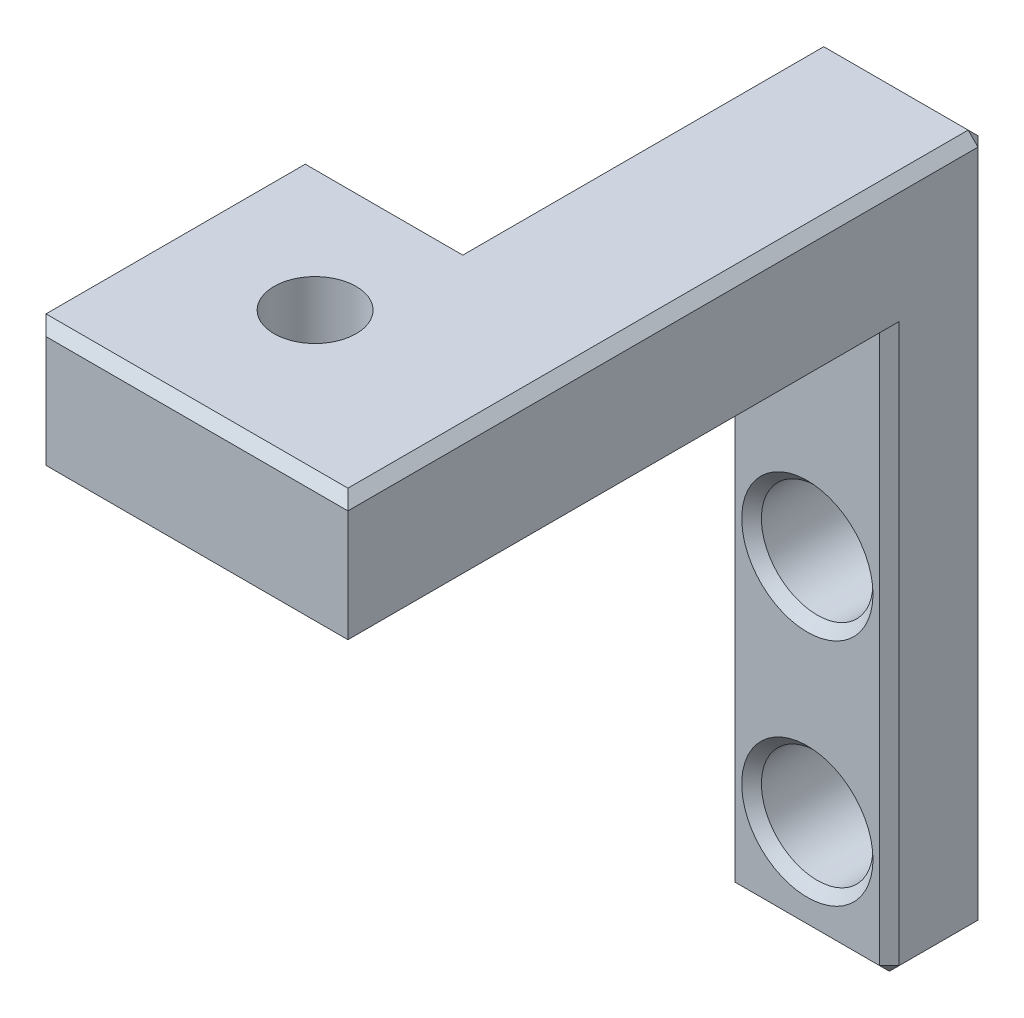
ISO-10303-21;
HEADER;
FILE_DESCRIPTION(('STEP AP214'),'2;1');
FILE_NAME('part.step','',(''),(''),'','','');
FILE_SCHEMA(('AUTOMOTIVE_DESIGN { 1 0 10303 214 1 1 1 1 }'));
ENDSEC;
DATA;
#1=APPLICATION_CONTEXT('core data for automotive mechanical design processes');
#2=APPLICATION_PROTOCOL_DEFINITION('international standard','automotive_design',2000,#1);
#3=PRODUCT_CONTEXT('',#1,'mechanical');
#4=PRODUCT('Part','Part','',(#3));
#5=PRODUCT_RELATED_PRODUCT_CATEGORY('part','',(#4));
#6=PRODUCT_DEFINITION_FORMATION('','',#4);
#7=PRODUCT_DEFINITION_CONTEXT('part definition',#1,'design');
#8=PRODUCT_DEFINITION('design','',#6,#7);
#9=PRODUCT_DEFINITION_SHAPE('','',#8);
#10=(LENGTH_UNIT() NAMED_UNIT(*) SI_UNIT(.MILLI.,.METRE.));
#11=(NAMED_UNIT(*) PLANE_ANGLE_UNIT() SI_UNIT($,.RADIAN.));
#12=(NAMED_UNIT(*) SI_UNIT($,.STERADIAN.) SOLID_ANGLE_UNIT());
#13=UNCERTAINTY_MEASURE_WITH_UNIT(LENGTH_MEASURE(1.E-05),#10,'distance_accuracy_value','');
#14=(GEOMETRIC_REPRESENTATION_CONTEXT(3) GLOBAL_UNCERTAINTY_ASSIGNED_CONTEXT((#13)) GLOBAL_UNIT_ASSIGNED_CONTEXT((#10,
#11,#12)) REPRESENTATION_CONTEXT('',''));
#15=CARTESIAN_POINT('',(0.,0.,0.));
#16=DIRECTION('',(0.,0.,1.));
#17=DIRECTION('',(1.,0.,0.));
#18=AXIS2_PLACEMENT_3D('',#15,#16,#17);
#19=CARTESIAN_POINT('',(2.5,10.5,3.));
#20=DIRECTION('',(-1.,0.,0.));
#21=DIRECTION('',(0.,-1.,0.));
#22=AXIS2_PLACEMENT_3D('',#19,#20,#21);
#23=PLANE('',#22);
#24=DIRECTION('',(0.,1.,0.));
#25=VECTOR('',#24,1.);
#26=CARTESIAN_POINT('',(2.5,10.5,19.5));
#27=LINE('',#26,#25);
#28=CARTESIAN_POINT('',(2.5,6.8,19.5));
#29=VERTEX_POINT('',#28);
#30=CARTESIAN_POINT('',(2.5,10.2,19.5));
#31=VERTEX_POINT('',#30);
#32=EDGE_CURVE('E211',#29,#31,#27,.T.);
#33=ORIENTED_EDGE('',*,*,#32,.F.);
#34=DIRECTION('',(0.,0.,-1.));
#35=VECTOR('',#34,1.);
#36=CARTESIAN_POINT('',(2.5,6.8,3.));
#37=LINE('',#36,#35);
#38=CARTESIAN_POINT('',(2.5,6.8,2.69999999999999));
#39=VERTEX_POINT('',#38);
#40=EDGE_CURVE('E262',#29,#39,#37,.T.);
#41=ORIENTED_EDGE('',*,*,#40,.T.);
#42=DIRECTION('',(0.,-1.,0.));
#43=VECTOR('',#42,1.);
#44=CARTESIAN_POINT('',(2.5,-10.5,2.69999999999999));
#45=LINE('',#44,#43);
#46=CARTESIAN_POINT('',(2.5,-10.2,2.69999999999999));
#47=VERTEX_POINT('',#46);
#48=EDGE_CURVE('E71',#39,#47,#45,.T.);
#49=ORIENTED_EDGE('',*,*,#48,.T.);
#50=DIRECTION('',(0.,0.,-1.));
#51=VECTOR('',#50,1.);
#52=CARTESIAN_POINT('',(2.5,-10.2,3.));
#53=LINE('',#52,#51);
#54=CARTESIAN_POINT('',(2.5,-10.2,0.300000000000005));
#55=VERTEX_POINT('',#54);
#56=EDGE_CURVE('E489',#47,#55,#53,.T.);
#57=ORIENTED_EDGE('',*,*,#56,.T.);
#58=DIRECTION('',(0.,1.,0.));
#59=VECTOR('',#58,1.);
#60=CARTESIAN_POINT('',(2.5,10.5,0.300000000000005));
#61=LINE('',#60,#59);
#62=CARTESIAN_POINT('',(2.5,10.2,0.300000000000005));
#63=VERTEX_POINT('',#62);
#64=EDGE_CURVE('E223',#55,#63,#61,.T.);
#65=ORIENTED_EDGE('',*,*,#64,.T.);
#66=DIRECTION('',(0.,0.,1.));
#67=VECTOR('',#66,1.);
#68=CARTESIAN_POINT('',(2.5,10.2,3.));
#69=LINE('',#68,#67);
#70=EDGE_CURVE('E199',#63,#31,#69,.T.);
#71=ORIENTED_EDGE('',*,*,#70,.T.);
#72=EDGE_LOOP('',(#33,#41,#49,#57,#65,#71));
#73=FACE_BOUND('',#72,.T.);
#74=ADVANCED_FACE('F53',(#73),#23,.F.);
#75=CARTESIAN_POINT('',(-2.5,10.5,3.));
#76=DIRECTION('',(0.,-1.,0.));
#77=DIRECTION('',(0.,0.,-1.));
#78=AXIS2_PLACEMENT_3D('',#75,#76,#77);
#79=PLANE('',#78);
#80=CARTESIAN_POINT('',(-3.,10.5,15.));
#81=DIRECTION('',(0.,-1.,0.));
#82=DIRECTION('',(0.,0.,-1.));
#83=AXIS2_PLACEMENT_3D('',#80,#81,#82);
#84=CIRCLE('',#83,1.25);
#85=CARTESIAN_POINT('',(-3.,10.5,13.75));
#86=VERTEX_POINT('',#85);
#87=EDGE_CURVE('E220',#86,#86,#84,.T.);
#88=ORIENTED_EDGE('',*,*,#87,.T.);
#89=EDGE_LOOP('',(#88));
#90=FACE_BOUND('',#89,.T.);
#91=DIRECTION('',(0.,0.,1.));
#92=VECTOR('',#91,1.);
#93=CARTESIAN_POINT('',(-2.2,10.5,3.));
#94=LINE('',#93,#92);
#95=CARTESIAN_POINT('',(-2.2,10.5,0.300000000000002));
#96=VERTEX_POINT('',#95);
#97=CARTESIAN_POINT('',(-2.2,10.5,11.3));
#98=VERTEX_POINT('',#97);
#99=EDGE_CURVE('E322',#96,#98,#94,.T.);
#100=ORIENTED_EDGE('',*,*,#99,.T.);
#101=DIRECTION('',(-1.,0.,0.));
#102=VECTOR('',#101,1.);
#103=CARTESIAN_POINT('',(-7.,10.5,11.3));
#104=LINE('',#103,#102);
#105=CARTESIAN_POINT('',(-7.,10.5,11.3));
#106=VERTEX_POINT('',#105);
#107=EDGE_CURVE('E422',#98,#106,#104,.T.);
#108=ORIENTED_EDGE('',*,*,#107,.T.);
#109=DIRECTION('',(0.,0.,-1.));
#110=VECTOR('',#109,1.);
#111=CARTESIAN_POINT('',(-7.,10.5,19.5));
#112=LINE('',#111,#110);
#113=CARTESIAN_POINT('',(-7.,10.5,19.2));
#114=VERTEX_POINT('',#113);
#115=EDGE_CURVE('E219',#114,#106,#112,.T.);
#116=ORIENTED_EDGE('',*,*,#115,.F.);
#117=DIRECTION('',(1.,0.,0.));
#118=VECTOR('',#117,1.);
#119=CARTESIAN_POINT('',(-2.5,10.5,19.2));
#120=LINE('',#119,#118);
#121=CARTESIAN_POINT('',(2.2,10.5,19.2));
#122=VERTEX_POINT('',#121);
#123=EDGE_CURVE('E419',#114,#122,#120,.T.);
#124=ORIENTED_EDGE('',*,*,#123,.T.);
#125=DIRECTION('',(0.,0.,-1.));
#126=VECTOR('',#125,1.);
#127=CARTESIAN_POINT('',(2.2,10.5,3.));
#128=LINE('',#127,#126);
#129=CARTESIAN_POINT('',(2.2,10.5,0.300000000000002));
#130=VERTEX_POINT('',#129);
#131=EDGE_CURVE('E201',#122,#130,#128,.T.);
#132=ORIENTED_EDGE('',*,*,#131,.T.);
#133=DIRECTION('',(-1.,0.,0.));
#134=VECTOR('',#133,1.);
#135=CARTESIAN_POINT('',(-2.5,10.5,0.300000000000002));
#136=LINE('',#135,#134);
#137=EDGE_CURVE('E437',#130,#96,#136,.T.);
#138=ORIENTED_EDGE('',*,*,#137,.T.);
#139=EDGE_LOOP('',(#100,#108,#116,#124,#132,#138));
#140=FACE_BOUND('',#139,.T.);
#141=ADVANCED_FACE('F555',(#90,#140),#79,.F.);
#142=CARTESIAN_POINT('',(-2.5,10.5,3.));
#143=DIRECTION('',(1.,0.,0.));
#144=DIRECTION('',(0.,1.,0.));
#145=AXIS2_PLACEMENT_3D('',#142,#143,#144);
#146=PLANE('',#145);
#147=DIRECTION('',(0.,1.,0.));
#148=VECTOR('',#147,1.);
#149=CARTESIAN_POINT('',(-2.5,6.50000000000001,2.69999999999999));
#150=LINE('',#149,#148);
#151=CARTESIAN_POINT('',(-2.5,-10.2,2.69999999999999));
#152=VERTEX_POINT('',#151);
#153=CARTESIAN_POINT('',(-2.5,6.8,2.69999999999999));
#154=VERTEX_POINT('',#153);
#155=EDGE_CURVE('E79',#152,#154,#150,.T.);
#156=ORIENTED_EDGE('',*,*,#155,.T.);
#157=DIRECTION('',(0.,0.,1.));
#158=VECTOR('',#157,1.);
#159=CARTESIAN_POINT('',(-2.5,6.8,3.));
#160=LINE('',#159,#158);
#161=CARTESIAN_POINT('',(-2.5,6.8,11.));
#162=VERTEX_POINT('',#161);
#163=EDGE_CURVE('E259',#154,#162,#160,.T.);
#164=ORIENTED_EDGE('',*,*,#163,.T.);
#165=DIRECTION('',(0.,-1.,0.));
#166=VECTOR('',#165,1.);
#167=CARTESIAN_POINT('',(-2.5,10.5,11.));
#168=LINE('',#167,#166);
#169=CARTESIAN_POINT('',(-2.5,10.2,11.));
#170=VERTEX_POINT('',#169);
#171=EDGE_CURVE('E225',#170,#162,#168,.T.);
#172=ORIENTED_EDGE('',*,*,#171,.F.);
#173=DIRECTION('',(0.,0.,-1.));
#174=VECTOR('',#173,1.);
#175=CARTESIAN_POINT('',(-2.5,10.2,3.));
#176=LINE('',#175,#174);
#177=CARTESIAN_POINT('',(-2.5,10.2,0.300000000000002));
#178=VERTEX_POINT('',#177);
#179=EDGE_CURVE('E448',#170,#178,#176,.T.);
#180=ORIENTED_EDGE('',*,*,#179,.T.);
#181=DIRECTION('',(0.,-1.,0.));
#182=VECTOR('',#181,1.);
#183=CARTESIAN_POINT('',(-2.5,10.5,0.300000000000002));
#184=LINE('',#183,#182);
#185=CARTESIAN_POINT('',(-2.5,-10.2,0.300000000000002));
#186=VERTEX_POINT('',#185);
#187=EDGE_CURVE('E445',#178,#186,#184,.T.);
#188=ORIENTED_EDGE('',*,*,#187,.T.);
#189=DIRECTION('',(0.,0.,1.));
#190=VECTOR('',#189,1.);
#191=CARTESIAN_POINT('',(-2.5,-10.2,3.));
#192=LINE('',#191,#190);
#193=EDGE_CURVE('E442',#186,#152,#192,.T.);
#194=ORIENTED_EDGE('',*,*,#193,.T.);
#195=EDGE_LOOP('',(#156,#164,#172,#180,#188,#194));
#196=FACE_BOUND('',#195,.T.);
#197=ADVANCED_FACE('F541',(#196),#146,.F.);
#198=CARTESIAN_POINT('',(-2.5,-10.5,3.));
#199=DIRECTION('',(0.,1.,0.));
#200=DIRECTION('',(0.,0.,1.));
#201=AXIS2_PLACEMENT_3D('',#198,#199,#200);
#202=PLANE('',#201);
#203=DIRECTION('',(0.,0.,-1.));
#204=VECTOR('',#203,1.);
#205=CARTESIAN_POINT('',(-2.2,-10.5,3.));
#206=LINE('',#205,#204);
#207=CARTESIAN_POINT('',(-2.2,-10.5,2.69999999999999));
#208=VERTEX_POINT('',#207);
#209=CARTESIAN_POINT('',(-2.2,-10.5,0.300000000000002));
#210=VERTEX_POINT('',#209);
#211=EDGE_CURVE('E471',#208,#210,#206,.T.);
#212=ORIENTED_EDGE('',*,*,#211,.T.);
#213=DIRECTION('',(1.,0.,0.));
#214=VECTOR('',#213,1.);
#215=CARTESIAN_POINT('',(-2.5,-10.5,0.300000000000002));
#216=LINE('',#215,#214);
#217=CARTESIAN_POINT('',(2.2,-10.5,0.300000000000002));
#218=VERTEX_POINT('',#217);
#219=EDGE_CURVE('E461',#210,#218,#216,.T.);
#220=ORIENTED_EDGE('',*,*,#219,.T.);
#221=DIRECTION('',(0.,0.,1.));
#222=VECTOR('',#221,1.);
#223=CARTESIAN_POINT('',(2.2,-10.5,3.));
#224=LINE('',#223,#222);
#225=CARTESIAN_POINT('',(2.2,-10.5,2.69999999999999));
#226=VERTEX_POINT('',#225);
#227=EDGE_CURVE('E465',#218,#226,#224,.T.);
#228=ORIENTED_EDGE('',*,*,#227,.T.);
#229=DIRECTION('',(-1.,0.,0.));
#230=VECTOR('',#229,1.);
#231=CARTESIAN_POINT('',(-2.5,-10.5,2.69999999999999));
#232=LINE('',#231,#230);
#233=EDGE_CURVE('E468',#226,#208,#232,.T.);
#234=ORIENTED_EDGE('',*,*,#233,.T.);
#235=EDGE_LOOP('',(#212,#220,#228,#234));
#236=FACE_BOUND('',#235,.T.);
#237=ADVANCED_FACE('F1020',(#236),#202,.F.);
#238=CARTESIAN_POINT('',(0.,0.,3.));
#239=DIRECTION('',(0.,0.,1.));
#240=DIRECTION('',(1.,0.,0.));
#241=AXIS2_PLACEMENT_3D('',#238,#239,#240);
#242=PLANE('',#241);
#243=CARTESIAN_POINT('',(0.,-7.5,3.));
#244=DIRECTION('',(0.,0.,1.));
#245=DIRECTION('',(1.,0.,0.));
#246=AXIS2_PLACEMENT_3D('',#243,#244,#245);
#247=CIRCLE('',#246,1.99999999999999);
#248=CARTESIAN_POINT('',(1.99999999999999,-7.5,3.));
#249=VERTEX_POINT('',#248);
#250=EDGE_CURVE('E415',#249,#249,#247,.F.);
#251=ORIENTED_EDGE('',*,*,#250,.T.);
#252=EDGE_LOOP('',(#251));
#253=FACE_BOUND('',#252,.T.);
#254=CARTESIAN_POINT('',(0.,-0.499999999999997,3.));
#255=DIRECTION('',(0.,0.,1.));
#256=DIRECTION('',(1.,0.,0.));
#257=AXIS2_PLACEMENT_3D('',#254,#255,#256);
#258=CIRCLE('',#257,1.99999999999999);
#259=CARTESIAN_POINT('',(1.99999999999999,-0.499999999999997,3.));
#260=VERTEX_POINT('',#259);
#261=EDGE_CURVE('E411',#260,#260,#258,.F.);
#262=ORIENTED_EDGE('',*,*,#261,.T.);
#263=EDGE_LOOP('',(#262));
#264=FACE_BOUND('',#263,.T.);
#265=DIRECTION('',(1.,0.,0.));
#266=VECTOR('',#265,1.);
#267=CARTESIAN_POINT('',(2.5,-10.2,3.));
#268=LINE('',#267,#266);
#269=CARTESIAN_POINT('',(-2.2,-10.2,3.));
#270=VERTEX_POINT('',#269);
#271=CARTESIAN_POINT('',(2.2,-10.2,3.));
#272=VERTEX_POINT('',#271);
#273=EDGE_CURVE('E458',#270,#272,#268,.T.);
#274=ORIENTED_EDGE('',*,*,#273,.T.);
#275=DIRECTION('',(0.,1.,0.));
#276=VECTOR('',#275,1.);
#277=CARTESIAN_POINT('',(2.2,6.5,3.));
#278=LINE('',#277,#276);
#279=CARTESIAN_POINT('',(2.2,6.5,3.));
#280=VERTEX_POINT('',#279);
#281=EDGE_CURVE('E451',#272,#280,#278,.T.);
#282=ORIENTED_EDGE('',*,*,#281,.T.);
#283=DIRECTION('',(1.,0.,0.));
#284=VECTOR('',#283,1.);
#285=CARTESIAN_POINT('',(-2.5,6.5,3.));
#286=LINE('',#285,#284);
#287=CARTESIAN_POINT('',(-2.2,6.5,3.));
#288=VERTEX_POINT('',#287);
#289=EDGE_CURVE('E497',#288,#280,#286,.T.);
#290=ORIENTED_EDGE('',*,*,#289,.F.);
#291=DIRECTION('',(0.,-1.,0.));
#292=VECTOR('',#291,1.);
#293=CARTESIAN_POINT('',(-2.2,-10.5,3.));
#294=LINE('',#293,#292);
#295=EDGE_CURVE('E455',#288,#270,#294,.T.);
#296=ORIENTED_EDGE('',*,*,#295,.T.);
#297=EDGE_LOOP('',(#274,#282,#290,#296));
#298=FACE_BOUND('',#297,.T.);
#299=ADVANCED_FACE('F778',(#253,#264,#298),#242,.T.);
#300=CARTESIAN_POINT('',(0.,0.,0.));
#301=DIRECTION('',(0.,0.,1.));
#302=DIRECTION('',(1.,0.,0.));
#303=AXIS2_PLACEMENT_3D('',#300,#301,#302);
#304=PLANE('',#303);
#305=CARTESIAN_POINT('',(0.,-7.5,0.));
#306=DIRECTION('',(0.,0.,1.));
#307=DIRECTION('',(1.,0.,0.));
#308=AXIS2_PLACEMENT_3D('',#305,#306,#307);
#309=CIRCLE('',#308,2.);
#310=CARTESIAN_POINT('',(2.,-7.5,0.));
#311=VERTEX_POINT('',#310);
#312=EDGE_CURVE('E391',#311,#311,#309,.T.);
#313=ORIENTED_EDGE('',*,*,#312,.T.);
#314=EDGE_LOOP('',(#313));
#315=FACE_BOUND('',#314,.T.);
#316=CARTESIAN_POINT('',(0.,-0.499999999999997,0.));
#317=DIRECTION('',(0.,0.,1.));
#318=DIRECTION('',(1.,0.,0.));
#319=AXIS2_PLACEMENT_3D('',#316,#317,#318);
#320=CIRCLE('',#319,2.);
#321=CARTESIAN_POINT('',(2.,-0.499999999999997,0.));
#322=VERTEX_POINT('',#321);
#323=EDGE_CURVE('E387',#322,#322,#320,.T.);
#324=ORIENTED_EDGE('',*,*,#323,.T.);
#325=EDGE_LOOP('',(#324));
#326=FACE_BOUND('',#325,.T.);
#327=DIRECTION('',(1.,0.,0.));
#328=VECTOR('',#327,1.);
#329=CARTESIAN_POINT('',(0.,10.2,0.));
#330=LINE('',#329,#328);
#331=CARTESIAN_POINT('',(-2.2,10.2,0.));
#332=VERTEX_POINT('',#331);
#333=CARTESIAN_POINT('',(2.2,10.2,0.));
#334=VERTEX_POINT('',#333);
#335=EDGE_CURVE('E484',#332,#334,#330,.T.);
#336=ORIENTED_EDGE('',*,*,#335,.T.);
#337=DIRECTION('',(0.,-1.,0.));
#338=VECTOR('',#337,1.);
#339=CARTESIAN_POINT('',(2.2,0.,0.));
#340=LINE('',#339,#338);
#341=CARTESIAN_POINT('',(2.2,-10.2,0.));
#342=VERTEX_POINT('',#341);
#343=EDGE_CURVE('E474',#334,#342,#340,.T.);
#344=ORIENTED_EDGE('',*,*,#343,.T.);
#345=DIRECTION('',(-1.,0.,0.));
#346=VECTOR('',#345,1.);
#347=CARTESIAN_POINT('',(0.,-10.2,0.));
#348=LINE('',#347,#346);
#349=CARTESIAN_POINT('',(-2.19999999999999,-10.2,0.));
#350=VERTEX_POINT('',#349);
#351=EDGE_CURVE('E478',#342,#350,#348,.T.);
#352=ORIENTED_EDGE('',*,*,#351,.T.);
#353=DIRECTION('',(0.,1.,0.));
#354=VECTOR('',#353,1.);
#355=CARTESIAN_POINT('',(-2.19999999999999,0.,0.));
#356=LINE('',#355,#354);
#357=EDGE_CURVE('E481',#350,#332,#356,.T.);
#358=ORIENTED_EDGE('',*,*,#357,.T.);
#359=EDGE_LOOP('',(#336,#344,#352,#358));
#360=FACE_BOUND('',#359,.T.);
#361=ADVANCED_FACE('F518',(#315,#326,#360),#304,.F.);
#362=CARTESIAN_POINT('',(-2.5,6.5,11.));
#363=DIRECTION('',(0.,1.,0.));
#364=DIRECTION('',(0.,0.,1.));
#365=AXIS2_PLACEMENT_3D('',#362,#363,#364);
#366=PLANE('',#365);
#367=CARTESIAN_POINT('',(-3.,6.5,15.));
#368=DIRECTION('',(0.,-1.,0.));
#369=DIRECTION('',(0.,0.,-1.));
#370=AXIS2_PLACEMENT_3D('',#367,#368,#369);
#371=CIRCLE('',#370,1.25);
#372=CARTESIAN_POINT('',(-3.,6.5,13.75));
#373=VERTEX_POINT('',#372);
#374=EDGE_CURVE('E386',#373,#373,#371,.T.);
#375=ORIENTED_EDGE('',*,*,#374,.F.);
#376=EDGE_LOOP('',(#375));
#377=FACE_BOUND('',#376,.T.);
#378=DIRECTION('',(1.,0.,0.));
#379=VECTOR('',#378,1.);
#380=CARTESIAN_POINT('',(-2.5,6.5,11.3));
#381=LINE('',#380,#379);
#382=CARTESIAN_POINT('',(-6.7,6.5,11.3));
#383=VERTEX_POINT('',#382);
#384=CARTESIAN_POINT('',(-2.2,6.5,11.3));
#385=VERTEX_POINT('',#384);
#386=EDGE_CURVE('E253',#383,#385,#381,.T.);
#387=ORIENTED_EDGE('',*,*,#386,.T.);
#388=DIRECTION('',(0.,0.,-1.));
#389=VECTOR('',#388,1.);
#390=CARTESIAN_POINT('',(-2.2,6.5,11.));
#391=LINE('',#390,#389);
#392=EDGE_CURVE('E256',#385,#288,#391,.T.);
#393=ORIENTED_EDGE('',*,*,#392,.T.);
#394=ORIENTED_EDGE('',*,*,#289,.T.);
#395=DIRECTION('',(0.,0.,1.));
#396=VECTOR('',#395,1.);
#397=CARTESIAN_POINT('',(2.2,6.5,11.));
#398=LINE('',#397,#396);
#399=CARTESIAN_POINT('',(2.2,6.5,19.2));
#400=VERTEX_POINT('',#399);
#401=EDGE_CURVE('E244',#280,#400,#398,.T.);
#402=ORIENTED_EDGE('',*,*,#401,.T.);
#403=DIRECTION('',(-1.,0.,0.));
#404=VECTOR('',#403,1.);
#405=CARTESIAN_POINT('',(-2.5,6.5,19.2));
#406=LINE('',#405,#404);
#407=CARTESIAN_POINT('',(-6.7,6.5,19.2));
#408=VERTEX_POINT('',#407);
#409=EDGE_CURVE('E247',#400,#408,#406,.T.);
#410=ORIENTED_EDGE('',*,*,#409,.T.);
#411=DIRECTION('',(0.,0.,-1.));
#412=VECTOR('',#411,1.);
#413=CARTESIAN_POINT('',(-6.7,6.5,11.));
#414=LINE('',#413,#412);
#415=EDGE_CURVE('E250',#408,#383,#414,.T.);
#416=ORIENTED_EDGE('',*,*,#415,.T.);
#417=EDGE_LOOP('',(#387,#393,#394,#402,#410,#416));
#418=FACE_BOUND('',#417,.T.);
#419=ADVANCED_FACE('F514',(#377,#418),#366,.F.);
#420=CARTESIAN_POINT('',(-7.,10.5,19.5));
#421=DIRECTION('',(1.,0.,0.));
#422=DIRECTION('',(0.,0.,-1.));
#423=AXIS2_PLACEMENT_3D('',#420,#421,#422);
#424=PLANE('',#423);
#425=DIRECTION('',(0.,0.,1.));
#426=VECTOR('',#425,1.);
#427=CARTESIAN_POINT('',(-7.,6.8,19.5));
#428=LINE('',#427,#426);
#429=CARTESIAN_POINT('',(-7.,6.8,11.3));
#430=VERTEX_POINT('',#429);
#431=CARTESIAN_POINT('',(-7.,6.8,19.2));
#432=VERTEX_POINT('',#431);
#433=EDGE_CURVE('E206',#430,#432,#428,.T.);
#434=ORIENTED_EDGE('',*,*,#433,.T.);
#435=DIRECTION('',(0.,1.,0.));
#436=VECTOR('',#435,1.);
#437=CARTESIAN_POINT('',(-7.,10.5,19.2));
#438=LINE('',#437,#436);
#439=EDGE_CURVE('E241',#432,#114,#438,.T.);
#440=ORIENTED_EDGE('',*,*,#439,.T.);
#441=ORIENTED_EDGE('',*,*,#115,.T.);
#442=DIRECTION('',(0.,-1.,0.));
#443=VECTOR('',#442,1.);
#444=CARTESIAN_POINT('',(-7.,6.5,11.3));
#445=LINE('',#444,#443);
#446=EDGE_CURVE('E238',#106,#430,#445,.T.);
#447=ORIENTED_EDGE('',*,*,#446,.T.);
#448=EDGE_LOOP('',(#434,#440,#441,#447));
#449=FACE_BOUND('',#448,.T.);
#450=ADVANCED_FACE('F517',(#449),#424,.F.);
#451=CARTESIAN_POINT('',(0.,0.,19.5));
#452=DIRECTION('',(0.,0.,-1.));
#453=DIRECTION('',(-1.,0.,0.));
#454=AXIS2_PLACEMENT_3D('',#451,#452,#453);
#455=PLANE('',#454);
#456=ORIENTED_EDGE('',*,*,#32,.T.);
#457=DIRECTION('',(-1.,0.,0.));
#458=VECTOR('',#457,1.);
#459=CARTESIAN_POINT('',(0.,10.2,19.5));
#460=LINE('',#459,#458);
#461=CARTESIAN_POINT('',(-6.7,10.2,19.5));
#462=VERTEX_POINT('',#461);
#463=EDGE_CURVE('E207',#31,#462,#460,.T.);
#464=ORIENTED_EDGE('',*,*,#463,.T.);
#465=DIRECTION('',(0.,-1.,0.));
#466=VECTOR('',#465,1.);
#467=CARTESIAN_POINT('',(-6.7,0.,19.5));
#468=LINE('',#467,#466);
#469=CARTESIAN_POINT('',(-6.7,6.8,19.5));
#470=VERTEX_POINT('',#469);
#471=EDGE_CURVE('E230',#462,#470,#468,.T.);
#472=ORIENTED_EDGE('',*,*,#471,.T.);
#473=DIRECTION('',(1.,0.,0.));
#474=VECTOR('',#473,1.);
#475=CARTESIAN_POINT('',(0.,6.8,19.5));
#476=LINE('',#475,#474);
#477=EDGE_CURVE('E215',#470,#29,#476,.T.);
#478=ORIENTED_EDGE('',*,*,#477,.T.);
#479=EDGE_LOOP('',(#456,#464,#472,#478));
#480=FACE_BOUND('',#479,.T.);
#481=ADVANCED_FACE('F212',(#480),#455,.F.);
#482=CARTESIAN_POINT('',(0.,0.,11.));
#483=DIRECTION('',(0.,0.,-1.));
#484=DIRECTION('',(-1.,0.,0.));
#485=AXIS2_PLACEMENT_3D('',#482,#483,#484);
#486=PLANE('',#485);
#487=DIRECTION('',(0.,1.,0.));
#488=VECTOR('',#487,1.);
#489=CARTESIAN_POINT('',(-6.7,10.5,11.));
#490=LINE('',#489,#488);
#491=CARTESIAN_POINT('',(-6.7,6.8,11.));
#492=VERTEX_POINT('',#491);
#493=CARTESIAN_POINT('',(-6.7,10.2,11.));
#494=VERTEX_POINT('',#493);
#495=EDGE_CURVE('E429',#492,#494,#490,.T.);
#496=ORIENTED_EDGE('',*,*,#495,.T.);
#497=DIRECTION('',(1.,0.,0.));
#498=VECTOR('',#497,1.);
#499=CARTESIAN_POINT('',(-2.2,10.2,11.));
#500=LINE('',#499,#498);
#501=EDGE_CURVE('E432',#494,#170,#500,.T.);
#502=ORIENTED_EDGE('',*,*,#501,.T.);
#503=ORIENTED_EDGE('',*,*,#171,.T.);
#504=DIRECTION('',(-1.,0.,0.));
#505=VECTOR('',#504,1.);
#506=CARTESIAN_POINT('',(-7.,6.8,11.));
#507=LINE('',#506,#505);
#508=EDGE_CURVE('E426',#162,#492,#507,.T.);
#509=ORIENTED_EDGE('',*,*,#508,.T.);
#510=EDGE_LOOP('',(#496,#502,#503,#509));
#511=FACE_BOUND('',#510,.T.);
#512=ADVANCED_FACE('F536',(#511),#486,.T.);
#513=CARTESIAN_POINT('',(0.,-7.5,-5.5));
#514=DIRECTION('',(0.,0.,1.));
#515=DIRECTION('',(1.,0.,0.));
#516=AXIS2_PLACEMENT_3D('',#513,#514,#515);
#517=CYLINDRICAL_SURFACE('',#516,1.7);
#518=CARTESIAN_POINT('',(0.,-7.5,0.300000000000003));
#519=DIRECTION('',(0.,0.,1.));
#520=DIRECTION('',(1.,0.,0.));
#521=AXIS2_PLACEMENT_3D('',#518,#519,#520);
#522=CIRCLE('',#521,1.7);
#523=CARTESIAN_POINT('',(1.7,-7.5,0.300000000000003));
#524=VERTEX_POINT('',#523);
#525=EDGE_CURVE('E399',#524,#524,#522,.F.);
#526=ORIENTED_EDGE('',*,*,#525,.T.);
#527=EDGE_LOOP('',(#526));
#528=FACE_BOUND('',#527,.T.);
#529=CARTESIAN_POINT('',(0.,-7.5,2.70000000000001));
#530=DIRECTION('',(0.,0.,1.));
#531=DIRECTION('',(1.,0.,0.));
#532=AXIS2_PLACEMENT_3D('',#529,#530,#531);
#533=CIRCLE('',#532,1.7);
#534=CARTESIAN_POINT('',(1.7,-7.5,2.70000000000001));
#535=VERTEX_POINT('',#534);
#536=EDGE_CURVE('E395',#535,#535,#533,.T.);
#537=ORIENTED_EDGE('',*,*,#536,.T.);
#538=EDGE_LOOP('',(#537));
#539=FACE_BOUND('',#538,.T.);
#540=ADVANCED_FACE('F966',(#528,#539),#517,.F.);
#541=CARTESIAN_POINT('',(0.,-0.499999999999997,-5.5));
#542=DIRECTION('',(0.,0.,1.));
#543=DIRECTION('',(1.,0.,0.));
#544=AXIS2_PLACEMENT_3D('',#541,#542,#543);
#545=CYLINDRICAL_SURFACE('',#544,1.7);
#546=CARTESIAN_POINT('',(0.,-0.499999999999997,0.300000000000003));
#547=DIRECTION('',(0.,0.,1.));
#548=DIRECTION('',(1.,0.,0.));
#549=AXIS2_PLACEMENT_3D('',#546,#547,#548);
#550=CIRCLE('',#549,1.7);
#551=CARTESIAN_POINT('',(1.7,-0.499999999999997,0.300000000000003));
#552=VERTEX_POINT('',#551);
#553=EDGE_CURVE('E407',#552,#552,#550,.F.);
#554=ORIENTED_EDGE('',*,*,#553,.T.);
#555=EDGE_LOOP('',(#554));
#556=FACE_BOUND('',#555,.T.);
#557=CARTESIAN_POINT('',(0.,-0.499999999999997,2.70000000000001));
#558=DIRECTION('',(0.,0.,1.));
#559=DIRECTION('',(1.,0.,0.));
#560=AXIS2_PLACEMENT_3D('',#557,#558,#559);
#561=CIRCLE('',#560,1.7);
#562=CARTESIAN_POINT('',(1.7,-0.499999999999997,2.70000000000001));
#563=VERTEX_POINT('',#562);
#564=EDGE_CURVE('E403',#563,#563,#561,.T.);
#565=ORIENTED_EDGE('',*,*,#564,.T.);
#566=EDGE_LOOP('',(#565));
#567=FACE_BOUND('',#566,.T.);
#568=ADVANCED_FACE('F956',(#556,#567),#545,.F.);
#569=CARTESIAN_POINT('',(-3.,6.5,15.));
#570=DIRECTION('',(0.,-1.,0.));
#571=DIRECTION('',(0.,0.,-1.));
#572=AXIS2_PLACEMENT_3D('',#569,#570,#571);
#573=CYLINDRICAL_SURFACE('',#572,1.25);
#574=ORIENTED_EDGE('',*,*,#87,.F.);
#575=EDGE_LOOP('',(#574));
#576=FACE_BOUND('',#575,.T.);
#577=ORIENTED_EDGE('',*,*,#374,.T.);
#578=EDGE_LOOP('',(#577));
#579=FACE_BOUND('',#578,.T.);
#580=ADVANCED_FACE('F512',(#576,#579),#573,.F.);
#581=CARTESIAN_POINT('',(-2.2,0.,3.));
#582=DIRECTION('',(-0.707106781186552,0.,0.707106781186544));
#583=DIRECTION('',(0.,1.,0.));
#584=AXIS2_PLACEMENT_3D('',#581,#582,#583);
#585=PLANE('',#584);
#586=DIRECTION('',(-0.707106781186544,0.,-0.707106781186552));
#587=VECTOR('',#586,1.);
#588=CARTESIAN_POINT('',(-2.2,-10.2,3.));
#589=LINE('',#588,#587);
#590=EDGE_CURVE('E382',#270,#152,#589,.T.);
#591=ORIENTED_EDGE('',*,*,#590,.F.);
#592=ORIENTED_EDGE('',*,*,#295,.F.);
#593=DIRECTION('',(0.577350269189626,-0.577350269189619,0.577350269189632));
#594=VECTOR('',#593,1.);
#595=CARTESIAN_POINT('',(0.466666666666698,3.83333333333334,5.66666666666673));
#596=LINE('',#595,#594);
#597=EDGE_CURVE('E64',#288,#154,#596,.F.);
#598=ORIENTED_EDGE('',*,*,#597,.T.);
#599=ORIENTED_EDGE('',*,*,#155,.F.);
#600=EDGE_LOOP('',(#591,#592,#598,#599));
#601=FACE_BOUND('',#600,.T.);
#602=ADVANCED_FACE('F696',(#601),#585,.T.);
#603=CARTESIAN_POINT('',(-2.2,-10.2,3.));
#604=DIRECTION('',(-0.577350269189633,-0.577350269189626,0.577350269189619));
#605=DIRECTION('',(0.707106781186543,-0.707106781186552,0.));
#606=AXIS2_PLACEMENT_3D('',#603,#604,#605);
#607=PLANE('',#606);
#608=DIRECTION('',(0.,0.707106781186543,0.707106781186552));
#609=VECTOR('',#608,1.);
#610=CARTESIAN_POINT('',(-2.2,-10.2,3.));
#611=LINE('',#610,#609);
#612=EDGE_CURVE('E374',#270,#208,#611,.F.);
#613=ORIENTED_EDGE('',*,*,#612,.F.);
#614=ORIENTED_EDGE('',*,*,#590,.T.);
#615=DIRECTION('',(-0.707106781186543,0.707106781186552,0.));
#616=VECTOR('',#615,1.);
#617=CARTESIAN_POINT('',(-2.35,-10.35,2.69999999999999));
#618=LINE('',#617,#616);
#619=EDGE_CURVE('E378',#208,#152,#618,.T.);
#620=ORIENTED_EDGE('',*,*,#619,.F.);
#621=EDGE_LOOP('',(#613,#614,#620));
#622=FACE_BOUND('',#621,.T.);
#623=ADVANCED_FACE('F689',(#622),#607,.T.);
#624=CARTESIAN_POINT('',(-2.2,-10.5,3.));
#625=DIRECTION('',(0.707106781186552,0.707106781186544,0.));
#626=DIRECTION('',(0.,0.,-1.));
#627=AXIS2_PLACEMENT_3D('',#624,#625,#626);
#628=PLANE('',#627);
#629=ORIENTED_EDGE('',*,*,#619,.T.);
#630=ORIENTED_EDGE('',*,*,#193,.F.);
#631=DIRECTION('',(0.707106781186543,-0.707106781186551,0.));
#632=VECTOR('',#631,1.);
#633=CARTESIAN_POINT('',(-2.35,-10.35,0.300000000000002));
#634=LINE('',#633,#632);
#635=EDGE_CURVE('E366',#210,#186,#634,.F.);
#636=ORIENTED_EDGE('',*,*,#635,.F.);
#637=ORIENTED_EDGE('',*,*,#211,.F.);
#638=EDGE_LOOP('',(#629,#630,#636,#637));
#639=FACE_BOUND('',#638,.T.);
#640=ADVANCED_FACE('F682',(#639),#628,.F.);
#641=CARTESIAN_POINT('',(0.,-10.2,3.));
#642=DIRECTION('',(0.,-0.707106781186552,0.707106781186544));
#643=DIRECTION('',(-1.,0.,0.));
#644=AXIS2_PLACEMENT_3D('',#641,#642,#643);
#645=PLANE('',#644);
#646=ORIENTED_EDGE('',*,*,#612,.T.);
#647=ORIENTED_EDGE('',*,*,#233,.F.);
#648=DIRECTION('',(0.,-0.707106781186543,-0.707106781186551));
#649=VECTOR('',#648,1.);
#650=CARTESIAN_POINT('',(2.2,-10.35,2.85));
#651=LINE('',#650,#649);
#652=EDGE_CURVE('E362',#272,#226,#651,.T.);
#653=ORIENTED_EDGE('',*,*,#652,.F.);
#654=ORIENTED_EDGE('',*,*,#273,.F.);
#655=EDGE_LOOP('',(#646,#647,#653,#654));
#656=FACE_BOUND('',#655,.T.);
#657=ADVANCED_FACE('F676',(#656),#645,.T.);
#658=CARTESIAN_POINT('',(2.2,0.,3.));
#659=DIRECTION('',(0.707106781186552,0.,0.707106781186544));
#660=DIRECTION('',(0.,-1.,0.));
#661=AXIS2_PLACEMENT_3D('',#658,#659,#660);
#662=PLANE('',#661);
#663=ORIENTED_EDGE('',*,*,#48,.F.);
#664=DIRECTION('',(0.577350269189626,0.577350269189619,-0.577350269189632));
#665=VECTOR('',#664,1.);
#666=CARTESIAN_POINT('',(2.4,6.7,2.8));
#667=LINE('',#666,#665);
#668=EDGE_CURVE('E11',#39,#280,#667,.F.);
#669=ORIENTED_EDGE('',*,*,#668,.T.);
#670=ORIENTED_EDGE('',*,*,#281,.F.);
#671=DIRECTION('',(-0.707106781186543,0.,0.707106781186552));
#672=VECTOR('',#671,1.);
#673=CARTESIAN_POINT('',(2.5,-10.2,2.69999999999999));
#674=LINE('',#673,#672);
#675=EDGE_CURVE('E358',#47,#272,#674,.T.);
#676=ORIENTED_EDGE('',*,*,#675,.F.);
#677=EDGE_LOOP('',(#663,#669,#670,#676));
#678=FACE_BOUND('',#677,.T.);
#679=ADVANCED_FACE('F670',(#678),#662,.T.);
#680=CARTESIAN_POINT('',(-2.5,10.2,3.));
#681=DIRECTION('',(0.707106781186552,-0.707106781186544,0.));
#682=DIRECTION('',(0.,0.,-1.));
#683=AXIS2_PLACEMENT_3D('',#680,#681,#682);
#684=PLANE('',#683);
#685=ORIENTED_EDGE('',*,*,#179,.F.);
#686=DIRECTION('',(-0.577350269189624,-0.57735026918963,-0.577350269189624));
#687=VECTOR('',#686,1.);
#688=CARTESIAN_POINT('',(-2.3,10.4,11.2));
#689=LINE('',#688,#687);
#690=EDGE_CURVE('E265',#170,#98,#689,.F.);
#691=ORIENTED_EDGE('',*,*,#690,.T.);
#692=ORIENTED_EDGE('',*,*,#99,.F.);
#693=DIRECTION('',(-0.707106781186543,-0.707106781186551,0.));
#694=VECTOR('',#693,1.);
#695=CARTESIAN_POINT('',(-2.35,10.35,0.300000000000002));
#696=LINE('',#695,#694);
#697=EDGE_CURVE('E354',#178,#96,#696,.F.);
#698=ORIENTED_EDGE('',*,*,#697,.F.);
#699=EDGE_LOOP('',(#685,#691,#692,#698));
#700=FACE_BOUND('',#699,.T.);
#701=ADVANCED_FACE('F546',(#700),#684,.F.);
#702=CARTESIAN_POINT('',(-2.5,10.5,0.300000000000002));
#703=DIRECTION('',(0.707106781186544,0.,0.707106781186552));
#704=DIRECTION('',(0.,-1.,0.));
#705=AXIS2_PLACEMENT_3D('',#702,#703,#704);
#706=PLANE('',#705);
#707=DIRECTION('',(-0.707106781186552,0.,0.707106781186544));
#708=VECTOR('',#707,1.);
#709=CARTESIAN_POINT('',(-2.19999999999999,-10.2,0.));
#710=LINE('',#709,#708);
#711=EDGE_CURVE('E370',#186,#350,#710,.F.);
#712=ORIENTED_EDGE('',*,*,#711,.F.);
#713=ORIENTED_EDGE('',*,*,#187,.F.);
#714=DIRECTION('',(0.707106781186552,0.,-0.707106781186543));
#715=VECTOR('',#714,1.);
#716=CARTESIAN_POINT('',(-2.2,10.2,0.));
#717=LINE('',#716,#715);
#718=EDGE_CURVE('E350',#332,#178,#717,.F.);
#719=ORIENTED_EDGE('',*,*,#718,.F.);
#720=ORIENTED_EDGE('',*,*,#357,.F.);
#721=EDGE_LOOP('',(#712,#713,#719,#720));
#722=FACE_BOUND('',#721,.T.);
#723=ADVANCED_FACE('F657',(#722),#706,.F.);
#724=CARTESIAN_POINT('',(-2.19999999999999,-10.2,0.));
#725=DIRECTION('',(-0.577350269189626,-0.577350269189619,-0.577350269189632));
#726=DIRECTION('',(-0.707106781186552,0.,0.707106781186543));
#727=AXIS2_PLACEMENT_3D('',#724,#725,#726);
#728=PLANE('',#727);
#729=ORIENTED_EDGE('',*,*,#635,.T.);
#730=ORIENTED_EDGE('',*,*,#711,.T.);
#731=DIRECTION('',(0.,0.707106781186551,-0.707106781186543));
#732=VECTOR('',#731,1.);
#733=CARTESIAN_POINT('',(-2.19999999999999,-10.2,0.));
#734=LINE('',#733,#732);
#735=EDGE_CURVE('E346',#210,#350,#734,.T.);
#736=ORIENTED_EDGE('',*,*,#735,.F.);
#737=EDGE_LOOP('',(#729,#730,#736));
#738=FACE_BOUND('',#737,.T.);
#739=ADVANCED_FACE('F650',(#738),#728,.T.);
#740=CARTESIAN_POINT('',(2.5,-10.2,2.69999999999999));
#741=DIRECTION('',(0.577350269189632,-0.577350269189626,0.577350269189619));
#742=DIRECTION('',(0.707106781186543,0.707106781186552,0.));
#743=AXIS2_PLACEMENT_3D('',#740,#741,#742);
#744=PLANE('',#743);
#745=ORIENTED_EDGE('',*,*,#675,.T.);
#746=ORIENTED_EDGE('',*,*,#652,.T.);
#747=DIRECTION('',(-0.707106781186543,-0.707106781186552,0.));
#748=VECTOR('',#747,1.);
#749=CARTESIAN_POINT('',(2.5,-10.2,2.69999999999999));
#750=LINE('',#749,#748);
#751=EDGE_CURVE('E342',#47,#226,#750,.T.);
#752=ORIENTED_EDGE('',*,*,#751,.F.);
#753=EDGE_LOOP('',(#745,#746,#752));
#754=FACE_BOUND('',#753,.T.);
#755=ADVANCED_FACE('F643',(#754),#744,.T.);
#756=CARTESIAN_POINT('',(-2.2,10.2,0.));
#757=DIRECTION('',(-0.577350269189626,0.577350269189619,-0.577350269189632));
#758=DIRECTION('',(-0.707106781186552,0.,0.707106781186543));
#759=AXIS2_PLACEMENT_3D('',#756,#757,#758);
#760=PLANE('',#759);
#761=ORIENTED_EDGE('',*,*,#718,.T.);
#762=ORIENTED_EDGE('',*,*,#697,.T.);
#763=DIRECTION('',(0.,0.707106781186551,0.707106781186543));
#764=VECTOR('',#763,1.);
#765=CARTESIAN_POINT('',(-2.2,10.2,0.));
#766=LINE('',#765,#764);
#767=EDGE_CURVE('E338',#332,#96,#766,.T.);
#768=ORIENTED_EDGE('',*,*,#767,.F.);
#769=EDGE_LOOP('',(#761,#762,#768));
#770=FACE_BOUND('',#769,.T.);
#771=ADVANCED_FACE('F636',(#770),#760,.T.);
#772=CARTESIAN_POINT('',(-2.5,-10.5,0.300000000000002));
#773=DIRECTION('',(0.,0.707106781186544,0.707106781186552));
#774=DIRECTION('',(1.,0.,0.));
#775=AXIS2_PLACEMENT_3D('',#772,#773,#774);
#776=PLANE('',#775);
#777=ORIENTED_EDGE('',*,*,#735,.T.);
#778=ORIENTED_EDGE('',*,*,#351,.F.);
#779=DIRECTION('',(0.,-0.707106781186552,0.707106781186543));
#780=VECTOR('',#779,1.);
#781=CARTESIAN_POINT('',(2.2,-10.2,0.));
#782=LINE('',#781,#780);
#783=EDGE_CURVE('E334',#218,#342,#782,.F.);
#784=ORIENTED_EDGE('',*,*,#783,.F.);
#785=ORIENTED_EDGE('',*,*,#219,.F.);
#786=EDGE_LOOP('',(#777,#778,#784,#785));
#787=FACE_BOUND('',#786,.T.);
#788=ADVANCED_FACE('F629',(#787),#776,.F.);
#789=CARTESIAN_POINT('',(2.5,-10.2,3.));
#790=DIRECTION('',(-0.707106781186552,0.707106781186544,0.));
#791=DIRECTION('',(0.,0.,-1.));
#792=AXIS2_PLACEMENT_3D('',#789,#790,#791);
#793=PLANE('',#792);
#794=ORIENTED_EDGE('',*,*,#751,.T.);
#795=ORIENTED_EDGE('',*,*,#227,.F.);
#796=DIRECTION('',(0.707106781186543,0.707106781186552,0.));
#797=VECTOR('',#796,1.);
#798=CARTESIAN_POINT('',(2.35,-10.35,0.300000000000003));
#799=LINE('',#798,#797);
#800=EDGE_CURVE('E331',#55,#218,#799,.F.);
#801=ORIENTED_EDGE('',*,*,#800,.F.);
#802=ORIENTED_EDGE('',*,*,#56,.F.);
#803=EDGE_LOOP('',(#794,#795,#801,#802));
#804=FACE_BOUND('',#803,.T.);
#805=ADVANCED_FACE('F623',(#804),#793,.F.);
#806=CARTESIAN_POINT('',(2.2,10.5,3.));
#807=DIRECTION('',(-0.707106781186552,-0.707106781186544,0.));
#808=DIRECTION('',(0.,0.,-1.));
#809=AXIS2_PLACEMENT_3D('',#806,#807,#808);
#810=PLANE('',#809);
#811=ORIENTED_EDGE('',*,*,#131,.F.);
#812=DIRECTION('',(0.577350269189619,-0.577350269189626,0.577350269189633));
#813=VECTOR('',#812,1.);
#814=CARTESIAN_POINT('',(-3.2,15.9000000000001,13.7999999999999));
#815=LINE('',#814,#813);
#816=EDGE_CURVE('E194',#122,#31,#815,.T.);
#817=ORIENTED_EDGE('',*,*,#816,.T.);
#818=ORIENTED_EDGE('',*,*,#70,.F.);
#819=DIRECTION('',(-0.707106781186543,0.707106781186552,0.));
#820=VECTOR('',#819,1.);
#821=CARTESIAN_POINT('',(2.5,10.2,0.300000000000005));
#822=LINE('',#821,#820);
#823=EDGE_CURVE('E328',#130,#63,#822,.F.);
#824=ORIENTED_EDGE('',*,*,#823,.F.);
#825=EDGE_LOOP('',(#811,#817,#818,#824));
#826=FACE_BOUND('',#825,.T.);
#827=ADVANCED_FACE('F196',(#826),#810,.F.);
#828=CARTESIAN_POINT('',(-2.5,10.5,0.300000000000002));
#829=DIRECTION('',(0.,-0.707106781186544,0.707106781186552));
#830=DIRECTION('',(-1.,0.,0.));
#831=AXIS2_PLACEMENT_3D('',#828,#829,#830);
#832=PLANE('',#831);
#833=ORIENTED_EDGE('',*,*,#767,.T.);
#834=ORIENTED_EDGE('',*,*,#137,.F.);
#835=DIRECTION('',(0.,-0.707106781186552,-0.707106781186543));
#836=VECTOR('',#835,1.);
#837=CARTESIAN_POINT('',(2.2,10.35,0.150000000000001));
#838=LINE('',#837,#836);
#839=EDGE_CURVE('E319',#334,#130,#838,.F.);
#840=ORIENTED_EDGE('',*,*,#839,.F.);
#841=ORIENTED_EDGE('',*,*,#335,.F.);
#842=EDGE_LOOP('',(#833,#834,#840,#841));
#843=FACE_BOUND('',#842,.T.);
#844=ADVANCED_FACE('F610',(#843),#832,.F.);
#845=CARTESIAN_POINT('',(2.2,-10.2,0.));
#846=DIRECTION('',(0.577350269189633,-0.577350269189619,-0.577350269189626));
#847=DIRECTION('',(-0.707106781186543,0.,-0.707106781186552));
#848=AXIS2_PLACEMENT_3D('',#845,#846,#847);
#849=PLANE('',#848);
#850=ORIENTED_EDGE('',*,*,#800,.T.);
#851=ORIENTED_EDGE('',*,*,#783,.T.);
#852=DIRECTION('',(-0.707106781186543,0.,-0.707106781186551));
#853=VECTOR('',#852,1.);
#854=CARTESIAN_POINT('',(2.2,-10.2,0.));
#855=LINE('',#854,#853);
#856=EDGE_CURVE('E312',#55,#342,#855,.T.);
#857=ORIENTED_EDGE('',*,*,#856,.F.);
#858=EDGE_LOOP('',(#850,#851,#857));
#859=FACE_BOUND('',#858,.T.);
#860=ADVANCED_FACE('F603',(#859),#849,.T.);
#861=CARTESIAN_POINT('',(2.5,10.2,0.300000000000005));
#862=DIRECTION('',(0.577350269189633,0.577350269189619,-0.577350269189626));
#863=DIRECTION('',(-0.707106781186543,0.,-0.707106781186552));
#864=AXIS2_PLACEMENT_3D('',#861,#862,#863);
#865=PLANE('',#864);
#866=ORIENTED_EDGE('',*,*,#839,.T.);
#867=ORIENTED_EDGE('',*,*,#823,.T.);
#868=DIRECTION('',(0.707106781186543,0.,0.707106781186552));
#869=VECTOR('',#868,1.);
#870=CARTESIAN_POINT('',(2.5,10.2,0.300000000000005));
#871=LINE('',#870,#869);
#872=EDGE_CURVE('E308',#334,#63,#871,.T.);
#873=ORIENTED_EDGE('',*,*,#872,.F.);
#874=EDGE_LOOP('',(#866,#867,#873));
#875=FACE_BOUND('',#874,.T.);
#876=ADVANCED_FACE('F597',(#875),#865,.T.);
#877=CARTESIAN_POINT('',(2.5,10.5,0.300000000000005));
#878=DIRECTION('',(-0.707106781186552,0.,0.707106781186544));
#879=DIRECTION('',(0.,1.,0.));
#880=AXIS2_PLACEMENT_3D('',#877,#878,#879);
#881=PLANE('',#880);
#882=ORIENTED_EDGE('',*,*,#856,.T.);
#883=ORIENTED_EDGE('',*,*,#343,.F.);
#884=ORIENTED_EDGE('',*,*,#872,.T.);
#885=ORIENTED_EDGE('',*,*,#64,.F.);
#886=EDGE_LOOP('',(#882,#883,#884,#885));
#887=FACE_BOUND('',#886,.T.);
#888=ADVANCED_FACE('F590',(#887),#881,.F.);
#889=CARTESIAN_POINT('',(0.,-7.5,0.));
#890=DIRECTION('',(0.,0.,-1.));
#891=DIRECTION('',(-1.,0.,0.));
#892=AXIS2_PLACEMENT_3D('',#889,#890,#891);
#893=CONICAL_SURFACE('',#892,2.,0.785398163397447);
#894=ORIENTED_EDGE('',*,*,#525,.F.);
#895=EDGE_LOOP('',(#894));
#896=FACE_BOUND('',#895,.T.);
#897=ORIENTED_EDGE('',*,*,#312,.F.);
#898=EDGE_LOOP('',(#897));
#899=FACE_BOUND('',#898,.T.);
#900=ADVANCED_FACE('F596',(#896,#899),#893,.F.);
#901=CARTESIAN_POINT('',(0.,-0.499999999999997,0.));
#902=DIRECTION('',(0.,0.,-1.));
#903=DIRECTION('',(-1.,0.,0.));
#904=AXIS2_PLACEMENT_3D('',#901,#902,#903);
#905=CONICAL_SURFACE('',#904,2.,0.785398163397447);
#906=ORIENTED_EDGE('',*,*,#553,.F.);
#907=EDGE_LOOP('',(#906));
#908=FACE_BOUND('',#907,.T.);
#909=ORIENTED_EDGE('',*,*,#323,.F.);
#910=EDGE_LOOP('',(#909));
#911=FACE_BOUND('',#910,.T.);
#912=ADVANCED_FACE('F708',(#908,#911),#905,.F.);
#913=CARTESIAN_POINT('',(0.,-7.5,2.70000000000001));
#914=DIRECTION('',(0.,0.,1.));
#915=DIRECTION('',(1.,0.,0.));
#916=AXIS2_PLACEMENT_3D('',#913,#914,#915);
#917=CONICAL_SURFACE('',#916,1.7,0.785398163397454);
#918=ORIENTED_EDGE('',*,*,#250,.F.);
#919=EDGE_LOOP('',(#918));
#920=FACE_BOUND('',#919,.T.);
#921=ORIENTED_EDGE('',*,*,#536,.F.);
#922=EDGE_LOOP('',(#921));
#923=FACE_BOUND('',#922,.T.);
#924=ADVANCED_FACE('F715',(#920,#923),#917,.F.);
#925=CARTESIAN_POINT('',(0.,-0.499999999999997,2.70000000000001));
#926=DIRECTION('',(0.,0.,1.));
#927=DIRECTION('',(1.,0.,0.));
#928=AXIS2_PLACEMENT_3D('',#925,#926,#927);
#929=CONICAL_SURFACE('',#928,1.7,0.785398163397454);
#930=ORIENTED_EDGE('',*,*,#261,.F.);
#931=EDGE_LOOP('',(#930));
#932=FACE_BOUND('',#931,.T.);
#933=ORIENTED_EDGE('',*,*,#564,.F.);
#934=EDGE_LOOP('',(#933));
#935=FACE_BOUND('',#934,.T.);
#936=ADVANCED_FACE('F722',(#932,#935),#929,.F.);
#937=CARTESIAN_POINT('',(0.,10.2,19.5));
#938=DIRECTION('',(0.,-0.707106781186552,-0.707106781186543));
#939=DIRECTION('',(-1.,0.,0.));
#940=AXIS2_PLACEMENT_3D('',#937,#938,#939);
#941=PLANE('',#940);
#942=ORIENTED_EDGE('',*,*,#816,.F.);
#943=ORIENTED_EDGE('',*,*,#123,.F.);
#944=DIRECTION('',(-0.577350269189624,0.577350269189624,-0.57735026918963));
#945=VECTOR('',#944,1.);
#946=CARTESIAN_POINT('',(-3.30000000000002,6.80000000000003,22.9));
#947=LINE('',#946,#945);
#948=EDGE_CURVE('E58',#462,#114,#947,.T.);
#949=ORIENTED_EDGE('',*,*,#948,.F.);
#950=ORIENTED_EDGE('',*,*,#463,.F.);
#951=EDGE_LOOP('',(#942,#943,#949,#950));
#952=FACE_BOUND('',#951,.T.);
#953=ADVANCED_FACE('F56',(#952),#941,.F.);
#954=CARTESIAN_POINT('',(2.5,6.8,3.));
#955=DIRECTION('',(-0.707106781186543,0.707106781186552,0.));
#956=DIRECTION('',(0.,0.,-1.));
#957=AXIS2_PLACEMENT_3D('',#954,#955,#956);
#958=PLANE('',#957);
#959=ORIENTED_EDGE('',*,*,#668,.F.);
#960=ORIENTED_EDGE('',*,*,#40,.F.);
#961=DIRECTION('',(-0.577350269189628,-0.577350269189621,-0.577350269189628));
#962=VECTOR('',#961,1.);
#963=CARTESIAN_POINT('',(-3.00000000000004,1.30000000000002,14.));
#964=LINE('',#963,#962);
#965=EDGE_CURVE('E301',#400,#29,#964,.F.);
#966=ORIENTED_EDGE('',*,*,#965,.F.);
#967=ORIENTED_EDGE('',*,*,#401,.F.);
#968=EDGE_LOOP('',(#959,#960,#966,#967));
#969=FACE_BOUND('',#968,.T.);
#970=ADVANCED_FACE('F764',(#969),#958,.F.);
#971=CARTESIAN_POINT('',(-6.7,0.,19.5));
#972=DIRECTION('',(0.707106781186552,0.,-0.707106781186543));
#973=DIRECTION('',(0.,-1.,0.));
#974=AXIS2_PLACEMENT_3D('',#971,#972,#973);
#975=PLANE('',#974);
#976=ORIENTED_EDGE('',*,*,#948,.T.);
#977=ORIENTED_EDGE('',*,*,#439,.F.);
#978=DIRECTION('',(0.707106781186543,0.,0.707106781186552));
#979=VECTOR('',#978,1.);
#980=CARTESIAN_POINT('',(-6.7,6.8,19.5));
#981=LINE('',#980,#979);
#982=EDGE_CURVE('E298',#470,#432,#981,.F.);
#983=ORIENTED_EDGE('',*,*,#982,.F.);
#984=ORIENTED_EDGE('',*,*,#471,.F.);
#985=EDGE_LOOP('',(#976,#977,#983,#984));
#986=FACE_BOUND('',#985,.T.);
#987=ADVANCED_FACE('F559',(#986),#975,.F.);
#988=CARTESIAN_POINT('',(0.,6.8,19.5));
#989=DIRECTION('',(0.,0.707106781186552,-0.707106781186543));
#990=DIRECTION('',(1.,0.,0.));
#991=AXIS2_PLACEMENT_3D('',#988,#989,#990);
#992=PLANE('',#991);
#993=ORIENTED_EDGE('',*,*,#965,.T.);
#994=ORIENTED_EDGE('',*,*,#477,.F.);
#995=DIRECTION('',(0.,-0.707106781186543,-0.707106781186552));
#996=VECTOR('',#995,1.);
#997=CARTESIAN_POINT('',(-6.7,6.8,19.5));
#998=LINE('',#997,#996);
#999=EDGE_CURVE('E294',#408,#470,#998,.F.);
#1000=ORIENTED_EDGE('',*,*,#999,.F.);
#1001=ORIENTED_EDGE('',*,*,#409,.F.);
#1002=EDGE_LOOP('',(#993,#994,#1000,#1001));
#1003=FACE_BOUND('',#1002,.T.);
#1004=ADVANCED_FACE('F757',(#1003),#992,.F.);
#1005=CARTESIAN_POINT('',(-6.7,6.8,19.5));
#1006=DIRECTION('',(-0.577350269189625,-0.577350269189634,0.577350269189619));
#1007=DIRECTION('',(0.707106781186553,-0.707106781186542,0.));
#1008=AXIS2_PLACEMENT_3D('',#1005,#1006,#1007);
#1009=PLANE('',#1008);
#1010=ORIENTED_EDGE('',*,*,#999,.T.);
#1011=ORIENTED_EDGE('',*,*,#982,.T.);
#1012=DIRECTION('',(-0.707106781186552,0.707106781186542,0.));
#1013=VECTOR('',#1012,1.);
#1014=CARTESIAN_POINT('',(-6.85,6.65,19.2));
#1015=LINE('',#1014,#1013);
#1016=EDGE_CURVE('E290',#408,#432,#1015,.T.);
#1017=ORIENTED_EDGE('',*,*,#1016,.F.);
#1018=EDGE_LOOP('',(#1010,#1011,#1017));
#1019=FACE_BOUND('',#1018,.T.);
#1020=ADVANCED_FACE('F562',(#1019),#1009,.T.);
#1021=CARTESIAN_POINT('',(-2.2,6.5,11.));
#1022=DIRECTION('',(0.707106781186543,0.707106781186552,0.));
#1023=DIRECTION('',(0.,0.,-1.));
#1024=AXIS2_PLACEMENT_3D('',#1021,#1022,#1023);
#1025=PLANE('',#1024);
#1026=ORIENTED_EDGE('',*,*,#597,.F.);
#1027=ORIENTED_EDGE('',*,*,#392,.F.);
#1028=DIRECTION('',(-0.577350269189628,0.577350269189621,-0.577350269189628));
#1029=VECTOR('',#1028,1.);
#1030=CARTESIAN_POINT('',(-2.3,6.6,11.2));
#1031=LINE('',#1030,#1029);
#1032=EDGE_CURVE('E286',#162,#385,#1031,.F.);
#1033=ORIENTED_EDGE('',*,*,#1032,.F.);
#1034=ORIENTED_EDGE('',*,*,#163,.F.);
#1035=EDGE_LOOP('',(#1026,#1027,#1033,#1034));
#1036=FACE_BOUND('',#1035,.T.);
#1037=ADVANCED_FACE('F530',(#1036),#1025,.F.);
#1038=CARTESIAN_POINT('',(-6.7,6.5,11.));
#1039=DIRECTION('',(0.707106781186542,0.707106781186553,0.));
#1040=DIRECTION('',(0.,0.,-1.));
#1041=AXIS2_PLACEMENT_3D('',#1038,#1039,#1040);
#1042=PLANE('',#1041);
#1043=ORIENTED_EDGE('',*,*,#1016,.T.);
#1044=ORIENTED_EDGE('',*,*,#433,.F.);
#1045=DIRECTION('',(0.707106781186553,-0.707106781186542,0.));
#1046=VECTOR('',#1045,1.);
#1047=CARTESIAN_POINT('',(-7.,6.8,11.3));
#1048=LINE('',#1047,#1046);
#1049=EDGE_CURVE('E282',#383,#430,#1048,.F.);
#1050=ORIENTED_EDGE('',*,*,#1049,.F.);
#1051=ORIENTED_EDGE('',*,*,#415,.F.);
#1052=EDGE_LOOP('',(#1043,#1044,#1050,#1051));
#1053=FACE_BOUND('',#1052,.T.);
#1054=ADVANCED_FACE('F565',(#1053),#1042,.F.);
#1055=CARTESIAN_POINT('',(-2.5,6.5,11.3));
#1056=DIRECTION('',(0.,-0.707106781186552,-0.707106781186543));
#1057=DIRECTION('',(-1.,0.,0.));
#1058=AXIS2_PLACEMENT_3D('',#1055,#1056,#1057);
#1059=PLANE('',#1058);
#1060=ORIENTED_EDGE('',*,*,#1032,.T.);
#1061=ORIENTED_EDGE('',*,*,#386,.F.);
#1062=DIRECTION('',(0.,-0.707106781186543,0.707106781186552));
#1063=VECTOR('',#1062,1.);
#1064=CARTESIAN_POINT('',(-6.7,6.65,11.15));
#1065=LINE('',#1064,#1063);
#1066=EDGE_CURVE('E278',#492,#383,#1065,.T.);
#1067=ORIENTED_EDGE('',*,*,#1066,.F.);
#1068=ORIENTED_EDGE('',*,*,#508,.F.);
#1069=EDGE_LOOP('',(#1060,#1061,#1067,#1068));
#1070=FACE_BOUND('',#1069,.T.);
#1071=ADVANCED_FACE('F533',(#1070),#1059,.T.);
#1072=CARTESIAN_POINT('',(-7.,6.8,11.3));
#1073=DIRECTION('',(-0.577350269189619,-0.577350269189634,-0.577350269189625));
#1074=DIRECTION('',(0.,0.707106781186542,-0.707106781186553));
#1075=AXIS2_PLACEMENT_3D('',#1072,#1073,#1074);
#1076=PLANE('',#1075);
#1077=ORIENTED_EDGE('',*,*,#1066,.T.);
#1078=ORIENTED_EDGE('',*,*,#1049,.T.);
#1079=DIRECTION('',(0.707106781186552,0.,-0.707106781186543));
#1080=VECTOR('',#1079,1.);
#1081=CARTESIAN_POINT('',(-7.,6.8,11.3));
#1082=LINE('',#1081,#1080);
#1083=EDGE_CURVE('E274',#492,#430,#1082,.F.);
#1084=ORIENTED_EDGE('',*,*,#1083,.F.);
#1085=EDGE_LOOP('',(#1077,#1078,#1084));
#1086=FACE_BOUND('',#1085,.T.);
#1087=ADVANCED_FACE('F567',(#1086),#1076,.T.);
#1088=CARTESIAN_POINT('',(-7.,10.5,11.3));
#1089=DIRECTION('',(-0.707106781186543,0.,-0.707106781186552));
#1090=DIRECTION('',(0.,1.,0.));
#1091=AXIS2_PLACEMENT_3D('',#1088,#1089,#1090);
#1092=PLANE('',#1091);
#1093=ORIENTED_EDGE('',*,*,#1083,.T.);
#1094=ORIENTED_EDGE('',*,*,#446,.F.);
#1095=DIRECTION('',(0.577350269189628,-0.577350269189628,-0.577350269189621));
#1096=VECTOR('',#1095,1.);
#1097=CARTESIAN_POINT('',(-7.,10.5,11.3));
#1098=LINE('',#1097,#1096);
#1099=EDGE_CURVE('E271',#494,#106,#1098,.F.);
#1100=ORIENTED_EDGE('',*,*,#1099,.F.);
#1101=ORIENTED_EDGE('',*,*,#495,.F.);
#1102=EDGE_LOOP('',(#1093,#1094,#1100,#1101));
#1103=FACE_BOUND('',#1102,.T.);
#1104=ADVANCED_FACE('F569',(#1103),#1092,.T.);
#1105=CARTESIAN_POINT('',(-2.5,10.5,11.3));
#1106=DIRECTION('',(0.,0.707106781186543,-0.707106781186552));
#1107=DIRECTION('',(1.,0.,0.));
#1108=AXIS2_PLACEMENT_3D('',#1105,#1106,#1107);
#1109=PLANE('',#1108);
#1110=ORIENTED_EDGE('',*,*,#690,.F.);
#1111=ORIENTED_EDGE('',*,*,#501,.F.);
#1112=ORIENTED_EDGE('',*,*,#1099,.T.);
#1113=ORIENTED_EDGE('',*,*,#107,.F.);
#1114=EDGE_LOOP('',(#1110,#1111,#1112,#1113));
#1115=FACE_BOUND('',#1114,.T.);
#1116=ADVANCED_FACE('F550',(#1115),#1109,.T.);
#1117=CLOSED_SHELL('',(#74,#141,#197,#237,#299,#361,#419,#450,#481,#512,#540,#568,#580,#602,
#623,#640,#657,#679,#701,#723,#739,#755,#771,#788,#805,#827,#844,#860,#876,#888,#900,#912,#924,
#936,#953,#970,#987,#1004,#1020,#1037,#1054,#1071,#1087,#1104,#1116));
#1118=MANIFOLD_SOLID_BREP('B2',#1117);
#1119=ADVANCED_BREP_SHAPE_REPRESENTATION('',(#18,#1118),#14);
#1120=SHAPE_DEFINITION_REPRESENTATION(#9,#1119);
ENDSEC;
END-ISO-10303-21;
